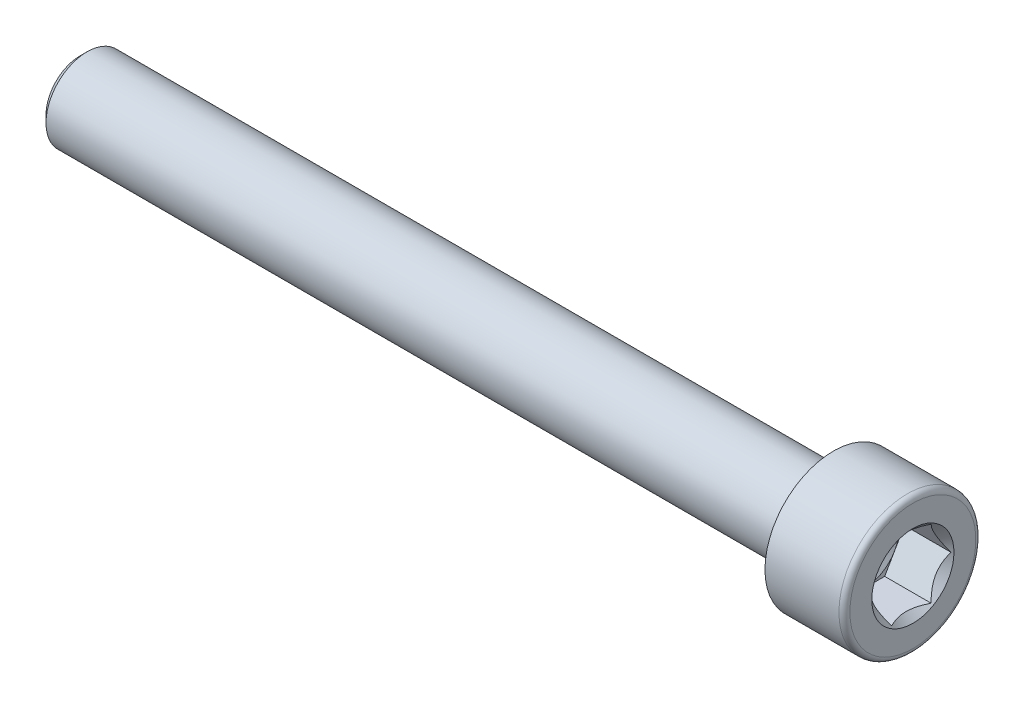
ISO-10303-21;
HEADER;
FILE_DESCRIPTION(('STEP AP214'),'2;1');
FILE_NAME('part.step','',(''),(''),'','','');
FILE_SCHEMA(('AUTOMOTIVE_DESIGN { 1 0 10303 214 1 1 1 1 }'));
ENDSEC;
DATA;
#1=APPLICATION_CONTEXT('core data for automotive mechanical design processes');
#2=APPLICATION_PROTOCOL_DEFINITION('international standard','automotive_design',2000,#1);
#3=PRODUCT_CONTEXT('',#1,'mechanical');
#4=PRODUCT('Part','Part','',(#3));
#5=PRODUCT_RELATED_PRODUCT_CATEGORY('part','',(#4));
#6=PRODUCT_DEFINITION_FORMATION('','',#4);
#7=PRODUCT_DEFINITION_CONTEXT('part definition',#1,'design');
#8=PRODUCT_DEFINITION('design','',#6,#7);
#9=PRODUCT_DEFINITION_SHAPE('','',#8);
#10=(LENGTH_UNIT() NAMED_UNIT(*) SI_UNIT(.MILLI.,.METRE.));
#11=(NAMED_UNIT(*) PLANE_ANGLE_UNIT() SI_UNIT($,.RADIAN.));
#12=(NAMED_UNIT(*) SI_UNIT($,.STERADIAN.) SOLID_ANGLE_UNIT());
#13=UNCERTAINTY_MEASURE_WITH_UNIT(LENGTH_MEASURE(1.E-05),#10,'distance_accuracy_value','');
#14=(GEOMETRIC_REPRESENTATION_CONTEXT(3) GLOBAL_UNCERTAINTY_ASSIGNED_CONTEXT((#13)) GLOBAL_UNIT_ASSIGNED_CONTEXT((#10,
#11,#12)) REPRESENTATION_CONTEXT('',''));
#15=CARTESIAN_POINT('',(0.,0.,0.));
#16=DIRECTION('',(0.,0.,1.));
#17=DIRECTION('',(1.,0.,0.));
#18=AXIS2_PLACEMENT_3D('',#15,#16,#17);
#19=CARTESIAN_POINT('',(-30.,0.,0.));
#20=DIRECTION('',(-1.,0.,0.));
#21=DIRECTION('',(0.,0.,1.));
#22=AXIS2_PLACEMENT_3D('',#19,#20,#21);
#23=CYLINDRICAL_SURFACE('',#22,3.);
#24=CARTESIAN_POINT('',(-54.5,0.,0.));
#25=DIRECTION('',(1.,0.,0.));
#26=DIRECTION('',(0.,0.,-1.));
#27=AXIS2_PLACEMENT_3D('',#24,#25,#26);
#28=CIRCLE('',#27,3.);
#29=CARTESIAN_POINT('',(-54.5,0.,-3.));
#30=VERTEX_POINT('',#29);
#31=EDGE_CURVE('E11',#30,#30,#28,.T.);
#32=ORIENTED_EDGE('',*,*,#31,.T.);
#33=EDGE_LOOP('',(#32));
#34=FACE_BOUND('',#33,.T.);
#35=CARTESIAN_POINT('',(0.,0.,0.));
#36=DIRECTION('',(-1.,0.,0.));
#37=DIRECTION('',(0.,0.,1.));
#38=AXIS2_PLACEMENT_3D('',#35,#36,#37);
#39=CIRCLE('',#38,3.);
#40=CARTESIAN_POINT('',(0.,0.,3.));
#41=VERTEX_POINT('',#40);
#42=EDGE_CURVE('E461',#41,#41,#39,.T.);
#43=ORIENTED_EDGE('',*,*,#42,.T.);
#44=EDGE_LOOP('',(#43));
#45=FACE_BOUND('',#44,.T.);
#46=ADVANCED_FACE('F348',(#34,#45),#23,.T.);
#47=CARTESIAN_POINT('',(-55.,0.,0.));
#48=DIRECTION('',(1.,0.,0.));
#49=DIRECTION('',(0.,0.,-1.));
#50=AXIS2_PLACEMENT_3D('',#47,#48,#49);
#51=PLANE('',#50);
#52=CARTESIAN_POINT('',(-55.,0.,0.));
#53=DIRECTION('',(1.,0.,0.));
#54=DIRECTION('',(0.,0.,-1.));
#55=AXIS2_PLACEMENT_3D('',#52,#53,#54);
#56=CIRCLE('',#55,2.5);
#57=CARTESIAN_POINT('',(-55.,0.,-2.5));
#58=VERTEX_POINT('',#57);
#59=EDGE_CURVE('E355',#58,#58,#56,.F.);
#60=ORIENTED_EDGE('',*,*,#59,.T.);
#61=EDGE_LOOP('',(#60));
#62=FACE_BOUND('',#61,.T.);
#63=ADVANCED_FACE('F535',(#62),#51,.F.);
#64=CARTESIAN_POINT('',(5.3,0.,0.));
#65=DIRECTION('',(1.,0.,0.));
#66=DIRECTION('',(0.,0.,-1.));
#67=AXIS2_PLACEMENT_3D('',#64,#65,#66);
#68=CONICAL_SURFACE('',#67,2.5,0.785398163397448);
#69=CARTESIAN_POINT('',(5.8,0.,0.));
#70=DIRECTION('',(-1.,0.,0.));
#71=DIRECTION('',(0.,0.,1.));
#72=AXIS2_PLACEMENT_3D('',#69,#70,#71);
#73=CIRCLE('',#72,3.);
#74=CARTESIAN_POINT('',(5.80000000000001,0.,3.));
#75=VERTEX_POINT('',#74);
#76=EDGE_CURVE('E484',#75,#75,#73,.T.);
#77=ORIENTED_EDGE('',*,*,#76,.F.);
#78=EDGE_LOOP('',(#77));
#79=FACE_BOUND('',#78,.T.);
#80=CARTESIAN_POINT('',(5.6868668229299,-2.50019999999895,1.44326020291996));
#81=CARTESIAN_POINT('',(5.63729205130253,-2.41426172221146,1.4928766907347));
#82=CARTESIAN_POINT('',(5.59062882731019,-2.32688643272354,1.54332283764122));
#83=CARTESIAN_POINT('',(5.50518948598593,-2.14871854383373,1.6461881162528));
#84=CARTESIAN_POINT('',(5.46646090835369,-2.05790899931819,1.69861703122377));
#85=CARTESIAN_POINT('',(5.40011804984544,-1.87479587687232,1.80433744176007));
#86=CARTESIAN_POINT('',(5.37233701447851,-1.78253893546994,1.85760201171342));
#87=CARTESIAN_POINT('',(5.32953452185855,-1.59599399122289,1.96530378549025));
#88=CARTESIAN_POINT('',(5.3144811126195,-1.50171168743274,2.01973769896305));
#89=CARTESIAN_POINT('',(5.30089906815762,-1.33922174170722,2.11355131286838));
#90=CARTESIAN_POINT('',(5.29888844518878,-1.27122403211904,2.15280980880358));
#91=CARTESIAN_POINT('',(5.30227546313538,-1.13533975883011,2.23126263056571));
#92=CARTESIAN_POINT('',(5.30767570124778,-1.0674532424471,2.27045692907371));
#93=CARTESIAN_POINT('',(5.32557713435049,-0.932321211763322,2.34847544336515));
#94=CARTESIAN_POINT('',(5.33808627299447,-0.865076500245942,2.38729919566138));
#95=CARTESIAN_POINT('',(5.36951884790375,-0.731749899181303,2.46427534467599));
#96=CARTESIAN_POINT('',(5.38844179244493,-0.66566792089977,2.50242779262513));
#97=CARTESIAN_POINT('',(5.44461870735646,-0.496403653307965,2.60015256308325));
#98=CARTESIAN_POINT('',(5.48610717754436,-0.39427087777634,2.65911894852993));
#99=CARTESIAN_POINT('',(5.55614539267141,-0.244093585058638,2.74582384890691));
#100=CARTESIAN_POINT('',(5.58075359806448,-0.194603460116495,2.7743969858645));
#101=CARTESIAN_POINT('',(5.63221323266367,-0.0965399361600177,2.83101398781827));
#102=CARTESIAN_POINT('',(5.65906328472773,-0.0479659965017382,2.85905816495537));
#103=CARTESIAN_POINT('',(5.6868668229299,0.000200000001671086,2.88686681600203));
#104=B_SPLINE_CURVE_WITH_KNOTS('',3,(#80,#81,#82,#83,#84,#85,#86,#87,#88,#89,#90,#91,#92,#93,
#94,#95,#96,#97,#98,#99,#100,#101,#102,#103),.UNSPECIFIED.,.F.,.F.,(4,2,2,2,2,2,2,2,2,2,2,4),
(0.,0.333012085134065,0.667964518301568,0.997597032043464,1.32639954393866,1.56169424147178,
1.79707142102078,2.03271213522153,2.26833478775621,2.64260240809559,2.82922877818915,
3.01574133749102),.UNSPECIFIED.);
#105=CARTESIAN_POINT('',(5.68675134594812,-2.49999999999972,1.44337567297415));
#106=VERTEX_POINT('',#105);
#107=CARTESIAN_POINT('',(5.68675134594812,6.66133814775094E-13,2.88675134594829));
#108=VERTEX_POINT('',#107);
#109=EDGE_CURVE('E489',#106,#108,#104,.T.);
#110=ORIENTED_EDGE('',*,*,#109,.T.);
#111=CARTESIAN_POINT('',(5.6868668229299,-0.00019999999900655,2.8868668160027));
#112=CARTESIAN_POINT('',(5.63729205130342,0.0857382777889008,2.83725032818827));
#113=CARTESIAN_POINT('',(5.59062882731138,0.173113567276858,2.78680418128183));
#114=CARTESIAN_POINT('',(5.50518948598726,0.351281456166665,2.68393890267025));
#115=CARTESIAN_POINT('',(5.46646090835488,0.442091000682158,2.63150998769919));
#116=CARTESIAN_POINT('',(5.40011804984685,0.625204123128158,2.52578957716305));
#117=CARTESIAN_POINT('',(5.37233701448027,0.71746106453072,2.47252500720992));
#118=CARTESIAN_POINT('',(5.32953452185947,0.904006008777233,2.36482323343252));
#119=CARTESIAN_POINT('',(5.31448111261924,0.998288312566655,2.31038931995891));
#120=CARTESIAN_POINT('',(5.30089906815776,1.16077825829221,2.21657570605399));
#121=CARTESIAN_POINT('',(5.29888844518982,1.2287759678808,2.17731721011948));
#122=CARTESIAN_POINT('',(5.30227546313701,1.36466024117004,2.0988643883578));
#123=CARTESIAN_POINT('',(5.3076757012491,1.43254675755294,2.05967008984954));
#124=CARTESIAN_POINT('',(5.32557713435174,1.56767878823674,1.98165157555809));
#125=CARTESIAN_POINT('',(5.33808627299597,1.63492349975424,1.9428278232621));
#126=CARTESIAN_POINT('',(5.36951884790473,1.76825010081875,1.86585167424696));
#127=CARTESIAN_POINT('',(5.38844179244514,1.83433207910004,1.82769922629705));
#128=CARTESIAN_POINT('',(5.44461870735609,2.00359634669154,1.72997445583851));
#129=CARTESIAN_POINT('',(5.48610717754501,2.10572912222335,1.67100807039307));
#130=CARTESIAN_POINT('',(5.55614539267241,2.25590641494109,1.58430317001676));
#131=CARTESIAN_POINT('',(5.58075359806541,2.30539653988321,1.55573003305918));
#132=CARTESIAN_POINT('',(5.63221323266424,2.40346006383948,1.49911303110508));
#133=CARTESIAN_POINT('',(5.65906328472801,2.45203400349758,1.47106885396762));
#134=CARTESIAN_POINT('',(5.6868668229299,2.50020000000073,1.4432602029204));
#135=B_SPLINE_CURVE_WITH_KNOTS('',3,(#111,#112,#113,#114,#115,#116,#117,#118,#119,#120,#121,
#122,#123,#124,#125,#126,#127,#128,#129,#130,#131,#132,#133,#134),.UNSPECIFIED.,.F.,.F.,(4,2,2,
2,2,2,2,2,2,2,2,4),(0.,0.333012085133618,0.667964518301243,0.997597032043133,1.32639954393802,
1.56169424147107,1.79707142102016,2.032712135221,2.26833478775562,2.64260240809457,
2.829228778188,3.01574133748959),.UNSPECIFIED.);
#136=CARTESIAN_POINT('',(5.68675134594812,2.50000000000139,1.44337567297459));
#137=VERTEX_POINT('',#136);
#138=EDGE_CURVE('E370',#108,#137,#135,.T.);
#139=ORIENTED_EDGE('',*,*,#138,.T.);
#140=CARTESIAN_POINT('',(6.74994835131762,2.50000000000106,-3.05811902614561));
#141=CARTESIAN_POINT('',(6.69289416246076,2.50000000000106,-2.98440983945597));
#142=CARTESIAN_POINT('',(6.63633840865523,2.50000000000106,-2.91030875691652));
#143=CARTESIAN_POINT('',(6.52445299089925,2.50000000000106,-2.76116077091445));
#144=CARTESIAN_POINT('',(6.46912361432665,2.50000000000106,-2.68611365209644));
#145=CARTESIAN_POINT('',(6.35952665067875,2.50000000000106,-2.53436379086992));
#146=CARTESIAN_POINT('',(6.30527051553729,2.50000000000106,-2.45765275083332));
#147=CARTESIAN_POINT('',(6.19860260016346,2.50000000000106,-2.30296317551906));
#148=CARTESIAN_POINT('',(6.14619069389,2.50000000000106,-2.22498472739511));
#149=CARTESIAN_POINT('',(6.04026321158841,2.50000000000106,-2.06236769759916));
#150=CARTESIAN_POINT('',(5.98690162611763,2.50000000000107,-1.97762830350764));
#151=CARTESIAN_POINT('',(5.88344307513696,2.50000000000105,-1.80618229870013));
#152=CARTESIAN_POINT('',(5.83334568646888,2.50000000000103,-1.719475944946));
#153=CARTESIAN_POINT('',(5.73745253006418,2.50000000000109,-1.54402392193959));
#154=CARTESIAN_POINT('',(5.6916447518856,2.50000000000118,-1.45528486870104));
#155=CARTESIAN_POINT('',(5.60536574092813,2.50000000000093,-1.27526975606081));
#156=CARTESIAN_POINT('',(5.56489195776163,2.50000000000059,-1.18399493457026));
#157=CARTESIAN_POINT('',(5.49462825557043,2.50000000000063,-1.00836471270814));
#158=CARTESIAN_POINT('',(5.46416406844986,2.50000000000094,-0.924281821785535));
#159=CARTESIAN_POINT('',(5.40996243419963,2.50000000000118,-0.753934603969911));
#160=CARTESIAN_POINT('',(5.38622540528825,2.50000000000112,-0.667670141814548));
#161=CARTESIAN_POINT('',(5.34717521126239,2.50000000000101,-0.495001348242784));
#162=CARTESIAN_POINT('',(5.33170602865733,2.50000000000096,-0.408632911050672));
#163=CARTESIAN_POINT('',(5.30952108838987,2.50000000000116,-0.234772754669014));
#164=CARTESIAN_POINT('',(5.30280339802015,2.5000000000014,-0.147281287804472));
#165=CARTESIAN_POINT('',(5.2987182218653,2.50000000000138,0.0238518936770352));
#166=CARTESIAN_POINT('',(5.3009308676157,2.50000000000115,0.107483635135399));
#167=CARTESIAN_POINT('',(5.31360968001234,2.50000000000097,0.274114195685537));
#168=CARTESIAN_POINT('',(5.32407657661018,2.50000000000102,0.357112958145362));
#169=CARTESIAN_POINT('',(5.35284213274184,2.5000000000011,0.523288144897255));
#170=CARTESIAN_POINT('',(5.37128080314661,2.50000000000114,0.606439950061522));
#171=CARTESIAN_POINT('',(5.41495620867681,2.50000000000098,0.770896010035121));
#172=CARTESIAN_POINT('',(5.44019262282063,2.50000000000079,0.852200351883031));
#173=CARTESIAN_POINT('',(5.52700067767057,2.50000000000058,1.10064624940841));
#174=CARTESIAN_POINT('',(5.59813375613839,2.50000000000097,1.26445670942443));
#175=CARTESIAN_POINT('',(5.71682012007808,2.50000000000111,1.504212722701));
#176=CARTESIAN_POINT('',(5.75847161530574,2.50000000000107,1.58328419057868));
#177=CARTESIAN_POINT('',(5.84501240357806,2.50000000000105,1.7396392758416));
#178=CARTESIAN_POINT('',(5.88990113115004,2.50000000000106,1.81692320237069));
#179=CARTESIAN_POINT('',(5.97999121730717,2.50000000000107,1.9661389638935));
#180=CARTESIAN_POINT('',(6.02506807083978,2.50000000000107,2.03814682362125));
#181=CARTESIAN_POINT('',(6.11714731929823,2.50000000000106,2.180926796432));
#182=CARTESIAN_POINT('',(6.16414985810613,2.50000000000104,2.25169881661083));
#183=CARTESIAN_POINT('',(6.25935501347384,2.50000000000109,2.39159945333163));
#184=CARTESIAN_POINT('',(6.30754501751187,2.50000000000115,2.46073668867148));
#185=CARTESIAN_POINT('',(6.40522114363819,2.50000000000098,2.59806183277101));
#186=CARTESIAN_POINT('',(6.45470690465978,2.50000000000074,2.66624999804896));
#187=CARTESIAN_POINT('',(6.50472334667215,2.50000000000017,2.73404006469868));
#188=B_SPLINE_CURVE_WITH_KNOTS('',3,(#140,#141,#142,#143,#144,#145,#146,#147,#148,#149,#150,
#151,#152,#153,#154,#155,#156,#157,#158,#159,#160,#161,#162,#163,#164,#165,#166,#167,#168,#169,
#170,#171,#172,#173,#174,#175,#176,#177,#178,#179,#180,#181,#182,#183,#184,#185,#186,#187),
.UNSPECIFIED.,.F.,.F.,(4,2,2,2,2,2,2,2,2,2,2,2,2,2,2,2,2,2,2,2,2,2,2,4),(0.,0.279636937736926,
0.55933872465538,0.841193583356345,1.1230291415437,1.42339426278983,1.72372036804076,
2.02317874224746,2.32249341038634,2.59055815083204,2.85863955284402,3.12146553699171,
3.3842334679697,3.63479445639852,3.88537760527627,4.14055298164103,4.39571631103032,
4.92983151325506,5.19792074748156,5.46596326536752,5.7207918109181,5.97563943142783,
6.22844778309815,6.48118642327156),.UNSPECIFIED.);
#189=CARTESIAN_POINT('',(5.68675134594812,2.50000000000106,-1.44337567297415));
#190=VERTEX_POINT('',#189);
#191=EDGE_CURVE('E526',#137,#190,#188,.F.);
#192=ORIENTED_EDGE('',*,*,#191,.T.);
#193=CARTESIAN_POINT('',(5.68686682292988,2.50020000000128,-1.44326020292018));
#194=CARTESIAN_POINT('',(5.63729205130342,2.41426172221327,-1.49287669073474));
#195=CARTESIAN_POINT('',(5.59062882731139,2.32688643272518,-1.54332283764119));
#196=CARTESIAN_POINT('',(5.50518948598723,2.14871854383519,-1.64618811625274));
#197=CARTESIAN_POINT('',(5.4664609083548,2.05790899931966,-1.69861703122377));
#198=CARTESIAN_POINT('',(5.40011804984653,1.87479587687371,-1.80433744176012));
#199=CARTESIAN_POINT('',(5.37233701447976,1.78253893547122,-1.85760201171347));
#200=CARTESIAN_POINT('',(5.32953452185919,1.5959939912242,-1.9653037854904));
#201=CARTESIAN_POINT('',(5.31448111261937,1.50171168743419,-2.01973769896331));
#202=CARTESIAN_POINT('',(5.30089906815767,1.33922174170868,-2.11355131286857));
#203=CARTESIAN_POINT('',(5.29888844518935,1.27122403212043,-2.15280980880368));
#204=CARTESIAN_POINT('',(5.30227546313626,1.13533975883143,-2.23126263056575));
#205=CARTESIAN_POINT('',(5.30767570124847,1.06745324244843,-2.2704569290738));
#206=CARTESIAN_POINT('',(5.32557713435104,0.932321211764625,-2.34847544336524));
#207=CARTESIAN_POINT('',(5.33808627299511,0.865076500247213,-2.38729919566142));
#208=CARTESIAN_POINT('',(5.36951884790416,0.731749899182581,-2.46427534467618));
#209=CARTESIAN_POINT('',(5.38844179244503,0.665667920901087,-2.50242779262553));
#210=CARTESIAN_POINT('',(5.44461870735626,0.496403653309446,-2.60015256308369));
#211=CARTESIAN_POINT('',(5.48610717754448,0.394270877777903,-2.65911894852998));
#212=CARTESIAN_POINT('',(5.5561453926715,0.244093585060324,-2.74582384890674));
#213=CARTESIAN_POINT('',(5.58075359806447,0.194603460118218,-2.77439698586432));
#214=CARTESIAN_POINT('',(5.63221323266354,0.0965399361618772,-2.83101398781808));
#215=CARTESIAN_POINT('',(5.65906328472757,0.0479659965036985,-2.85905816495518));
#216=CARTESIAN_POINT('',(5.68686682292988,-0.000199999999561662,-2.88686681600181));
#217=B_SPLINE_CURVE_WITH_KNOTS('',3,(#193,#194,#195,#196,#197,#198,#199,#200,#201,#202,#203,
#204,#205,#206,#207,#208,#209,#210,#211,#212,#213,#214,#215,#216),.UNSPECIFIED.,.F.,.F.,(4,2,2,
2,2,2,2,2,2,2,2,4),(0.,0.333012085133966,0.667964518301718,0.997597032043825,1.32639954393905,
1.56169424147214,1.79707142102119,2.03271213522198,2.26833478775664,2.64260240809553,
2.82922877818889,3.0157413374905),.UNSPECIFIED.);
#218=CARTESIAN_POINT('',(5.68675134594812,7.7715611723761E-13,-2.88675134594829));
#219=VERTEX_POINT('',#218);
#220=EDGE_CURVE('E609',#190,#219,#217,.T.);
#221=ORIENTED_EDGE('',*,*,#220,.T.);
#222=CARTESIAN_POINT('',(5.68686682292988,0.000200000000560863,-2.88686681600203));
#223=CARTESIAN_POINT('',(5.63729205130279,-0.085738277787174,-2.83725032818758));
#224=CARTESIAN_POINT('',(5.59062882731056,-0.173113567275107,-2.78680418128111));
#225=CARTESIAN_POINT('',(5.50518948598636,-0.351281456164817,-2.68393890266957));
#226=CARTESIAN_POINT('',(5.46646090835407,-0.442091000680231,-2.63150998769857));
#227=CARTESIAN_POINT('',(5.40011804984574,-0.625204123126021,-2.52578957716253));
#228=CARTESIAN_POINT('',(5.37233701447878,-0.717461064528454,-2.47252500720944));
#229=CARTESIAN_POINT('',(5.3295345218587,-0.904006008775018,-2.3648232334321));
#230=CARTESIAN_POINT('',(5.31448111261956,-0.998288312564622,-2.31038931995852));
#231=CARTESIAN_POINT('',(5.30089906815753,-1.16077825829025,-2.2165757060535));
#232=CARTESIAN_POINT('',(5.29888844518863,-1.22877596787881,-2.1773172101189));
#233=CARTESIAN_POINT('',(5.30227546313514,-1.36466024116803,-2.0988643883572));
#234=CARTESIAN_POINT('',(5.30767570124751,-1.43254675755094,-2.059670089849));
#235=CARTESIAN_POINT('',(5.32557713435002,-1.56767878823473,-1.98165157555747));
#236=CARTESIAN_POINT('',(5.33808627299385,-1.63492349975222,-1.94282782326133));
#237=CARTESIAN_POINT('',(5.36951884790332,-1.76825010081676,-1.86585167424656));
#238=CARTESIAN_POINT('',(5.38844179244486,-1.83433207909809,-1.82769922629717));
#239=CARTESIAN_POINT('',(5.44461870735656,-2.00359634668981,-1.72997445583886));
#240=CARTESIAN_POINT('',(5.48610717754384,-2.10572912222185,-1.67100807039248));
#241=CARTESIAN_POINT('',(5.55614539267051,-2.25590641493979,-1.58430317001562));
#242=CARTESIAN_POINT('',(5.58075359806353,-2.30539653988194,-1.555730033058));
#243=CARTESIAN_POINT('',(5.63221323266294,-2.4034600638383,-1.49911303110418));
#244=CARTESIAN_POINT('',(5.65906328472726,-2.45203400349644,-1.47106885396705));
#245=CARTESIAN_POINT('',(5.6868668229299,-2.50019999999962,-1.4432602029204));
#246=B_SPLINE_CURVE_WITH_KNOTS('',3,(#222,#223,#224,#225,#226,#227,#228,#229,#230,#231,#232,
#233,#234,#235,#236,#237,#238,#239,#240,#241,#242,#243,#244,#245),.UNSPECIFIED.,.F.,.F.,(4,2,2,
2,2,2,2,2,2,2,2,4),(0.,0.333012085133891,0.667964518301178,0.99759703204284,1.32639954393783,
1.56169424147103,1.79707142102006,2.03271213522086,2.26833478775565,2.64260240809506,
2.82922877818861,3.01574133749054),.UNSPECIFIED.);
#247=CARTESIAN_POINT('',(5.68675134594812,-2.4999999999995,-1.44337567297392));
#248=VERTEX_POINT('',#247);
#249=EDGE_CURVE('E610',#219,#248,#246,.T.);
#250=ORIENTED_EDGE('',*,*,#249,.T.);
#251=CARTESIAN_POINT('',(6.74994835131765,-2.49999999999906,-3.05811902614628));
#252=CARTESIAN_POINT('',(6.69289416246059,-2.49999999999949,-2.9844098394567));
#253=CARTESIAN_POINT('',(6.63633840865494,-2.49999999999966,-2.91030875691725));
#254=CARTESIAN_POINT('',(6.52445299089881,-2.49999999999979,-2.76116077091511));
#255=CARTESIAN_POINT('',(6.46912361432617,-2.49999999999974,-2.68611365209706));
#256=CARTESIAN_POINT('',(6.35952665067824,-2.49999999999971,-2.53436379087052));
#257=CARTESIAN_POINT('',(6.30527051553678,-2.49999999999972,-2.45765275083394));
#258=CARTESIAN_POINT('',(6.19860260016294,-2.49999999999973,-2.30296317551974));
#259=CARTESIAN_POINT('',(6.14619069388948,-2.49999999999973,-2.22498472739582));
#260=CARTESIAN_POINT('',(6.04026321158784,-2.49999999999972,-2.06236769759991));
#261=CARTESIAN_POINT('',(5.98690162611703,-2.49999999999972,-1.9776283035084));
#262=CARTESIAN_POINT('',(5.88344307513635,-2.49999999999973,-1.8061822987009));
#263=CARTESIAN_POINT('',(5.8333456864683,-2.49999999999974,-1.71947594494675));
#264=CARTESIAN_POINT('',(5.73745253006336,-2.49999999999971,-1.54402392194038));
#265=CARTESIAN_POINT('',(5.6916447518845,-2.49999999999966,-1.45528486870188));
#266=CARTESIAN_POINT('',(5.60536574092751,-2.49999999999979,-1.27526975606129));
#267=CARTESIAN_POINT('',(5.56489195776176,-2.49999999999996,-1.18399493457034));
#268=CARTESIAN_POINT('',(5.49462825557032,-2.49999999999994,-1.00836471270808));
#269=CARTESIAN_POINT('',(5.46416406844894,-2.49999999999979,-0.924281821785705));
#270=CARTESIAN_POINT('',(5.40996243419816,-2.49999999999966,-0.753934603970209));
#271=CARTESIAN_POINT('',(5.38622540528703,-2.49999999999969,-0.667670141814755));
#272=CARTESIAN_POINT('',(5.34717521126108,-2.49999999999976,-0.495001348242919));
#273=CARTESIAN_POINT('',(5.33170602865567,-2.49999999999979,-0.408632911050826));
#274=CARTESIAN_POINT('',(5.30952108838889,-2.49999999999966,-0.234772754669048));
#275=CARTESIAN_POINT('',(5.30280339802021,-2.49999999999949,-0.147281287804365));
#276=CARTESIAN_POINT('',(5.29871822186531,-2.49999999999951,0.0238518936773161));
#277=CARTESIAN_POINT('',(5.30093086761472,-2.49999999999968,0.107483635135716));
#278=CARTESIAN_POINT('',(5.3136096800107,-2.49999999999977,0.274114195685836));
#279=CARTESIAN_POINT('',(5.32407657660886,-2.4999999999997,0.357112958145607));
#280=CARTESIAN_POINT('',(5.3528421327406,-2.49999999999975,0.523288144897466));
#281=CARTESIAN_POINT('',(5.37128080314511,-2.49999999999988,0.606439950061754));
#282=CARTESIAN_POINT('',(5.41495620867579,-2.49999999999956,0.770896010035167));
#283=CARTESIAN_POINT('',(5.44019262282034,-2.49999999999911,0.852200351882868));
#284=CARTESIAN_POINT('',(5.5270006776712,-2.4999999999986,1.10064624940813));
#285=CARTESIAN_POINT('',(5.59813375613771,-2.49999999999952,1.26445670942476));
#286=CARTESIAN_POINT('',(5.71682012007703,-2.49999999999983,1.50421272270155));
#287=CARTESIAN_POINT('',(5.75847161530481,-2.49999999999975,1.58328419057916));
#288=CARTESIAN_POINT('',(5.84501240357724,-2.49999999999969,1.73963927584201));
#289=CARTESIAN_POINT('',(5.88990113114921,-2.49999999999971,1.81692320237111));
#290=CARTESIAN_POINT('',(5.97999121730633,-2.49999999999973,1.96613896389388));
#291=CARTESIAN_POINT('',(6.02506807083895,-2.49999999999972,2.0381468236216));
#292=CARTESIAN_POINT('',(6.1171473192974,-2.49999999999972,2.18092679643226));
#293=CARTESIAN_POINT('',(6.1641498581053,-2.49999999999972,2.25169881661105));
#294=CARTESIAN_POINT('',(6.259355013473,-2.49999999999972,2.39159945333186));
#295=CARTESIAN_POINT('',(6.30754501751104,-2.49999999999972,2.46073668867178));
#296=CARTESIAN_POINT('',(6.40522114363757,-2.49999999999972,2.59806183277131));
#297=CARTESIAN_POINT('',(6.45470690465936,-2.49999999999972,2.6662499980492));
#298=CARTESIAN_POINT('',(6.50472334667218,-2.49999999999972,2.73404006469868));
#299=B_SPLINE_CURVE_WITH_KNOTS('',3,(#251,#252,#253,#254,#255,#256,#257,#258,#259,#260,#261,
#262,#263,#264,#265,#266,#267,#268,#269,#270,#271,#272,#273,#274,#275,#276,#277,#278,#279,#280,
#281,#282,#283,#284,#285,#286,#287,#288,#289,#290,#291,#292,#293,#294,#295,#296,#297,#298),
.UNSPECIFIED.,.F.,.F.,(4,2,2,2,2,2,2,2,2,2,2,2,2,2,2,2,2,2,2,2,2,2,2,4),(0.,0.279636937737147,
0.559338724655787,0.841193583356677,1.12302914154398,1.42339426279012,1.72372036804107,
2.02317874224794,2.3224934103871,2.59055815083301,2.85863955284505,3.12146553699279,
3.38423346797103,3.63479445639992,3.88537760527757,4.14055298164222,4.39571631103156,
4.92983151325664,5.19792074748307,5.46596326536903,5.72079181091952,5.97563943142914,
6.22844778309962,6.48118642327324),.UNSPECIFIED.);
#300=EDGE_CURVE('E497',#248,#106,#299,.T.);
#301=ORIENTED_EDGE('',*,*,#300,.T.);
#302=EDGE_LOOP('',(#110,#139,#192,#221,#250,#301));
#303=FACE_BOUND('',#302,.T.);
#304=ADVANCED_FACE('F503',(#79,#303),#68,.F.);
#305=CARTESIAN_POINT('',(5.8,4.60000000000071,2.22044604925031E-13));
#306=DIRECTION('',(-1.,0.,0.));
#307=DIRECTION('',(0.,0.,1.));
#308=AXIS2_PLACEMENT_3D('',#305,#306,#307);
#309=PLANE('',#308);
#310=CARTESIAN_POINT('',(5.8,0.,0.));
#311=DIRECTION('',(-1.,0.,0.));
#312=DIRECTION('',(0.,0.,1.));
#313=AXIS2_PLACEMENT_3D('',#310,#311,#312);
#314=CIRCLE('',#313,4.6);
#315=CARTESIAN_POINT('',(5.80000000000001,0.,4.6));
#316=VERTEX_POINT('',#315);
#317=EDGE_CURVE('E481',#316,#316,#314,.T.);
#318=ORIENTED_EDGE('',*,*,#317,.F.);
#319=EDGE_LOOP('',(#318));
#320=FACE_BOUND('',#319,.T.);
#321=ORIENTED_EDGE('',*,*,#76,.T.);
#322=EDGE_LOOP('',(#321));
#323=FACE_BOUND('',#322,.T.);
#324=ADVANCED_FACE('F568',(#320,#323),#309,.F.);
#325=CARTESIAN_POINT('',(5.39999999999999,0.,0.));
#326=DIRECTION('',(-1.,0.,0.));
#327=DIRECTION('',(0.,0.,1.));
#328=AXIS2_PLACEMENT_3D('',#325,#326,#327);
#329=TOROIDAL_SURFACE('',#328,4.6,0.4);
#330=CARTESIAN_POINT('',(5.39999999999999,0.,0.));
#331=DIRECTION('',(-1.,0.,0.));
#332=DIRECTION('',(0.,0.,1.));
#333=AXIS2_PLACEMENT_3D('',#330,#331,#332);
#334=CIRCLE('',#333,5.);
#335=CARTESIAN_POINT('',(5.4,0.,5.00000000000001));
#336=VERTEX_POINT('',#335);
#337=EDGE_CURVE('E478',#336,#336,#334,.T.);
#338=ORIENTED_EDGE('',*,*,#337,.F.);
#339=EDGE_LOOP('',(#338));
#340=FACE_BOUND('',#339,.T.);
#341=ORIENTED_EDGE('',*,*,#317,.T.);
#342=EDGE_LOOP('',(#341));
#343=FACE_BOUND('',#342,.T.);
#344=ADVANCED_FACE('F563',(#340,#343),#329,.T.);
#345=CARTESIAN_POINT('',(-30.,0.,0.));
#346=DIRECTION('',(-1.,0.,0.));
#347=DIRECTION('',(0.,0.,1.));
#348=AXIS2_PLACEMENT_3D('',#345,#346,#347);
#349=CYLINDRICAL_SURFACE('',#348,5.);
#350=CARTESIAN_POINT('',(0.,0.,0.));
#351=DIRECTION('',(-1.,0.,0.));
#352=DIRECTION('',(0.,0.,1.));
#353=AXIS2_PLACEMENT_3D('',#350,#351,#352);
#354=CIRCLE('',#353,5.);
#355=CARTESIAN_POINT('',(0.,0.,5.));
#356=VERTEX_POINT('',#355);
#357=EDGE_CURVE('E475',#356,#356,#354,.T.);
#358=ORIENTED_EDGE('',*,*,#357,.F.);
#359=EDGE_LOOP('',(#358));
#360=FACE_BOUND('',#359,.T.);
#361=ORIENTED_EDGE('',*,*,#337,.T.);
#362=EDGE_LOOP('',(#361));
#363=FACE_BOUND('',#362,.T.);
#364=ADVANCED_FACE('F558',(#360,#363),#349,.T.);
#365=CARTESIAN_POINT('',(0.,3.00000000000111,2.22044604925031E-13));
#366=DIRECTION('',(1.,0.,0.));
#367=DIRECTION('',(0.,0.,-1.));
#368=AXIS2_PLACEMENT_3D('',#365,#366,#367);
#369=PLANE('',#368);
#370=ORIENTED_EDGE('',*,*,#42,.F.);
#371=EDGE_LOOP('',(#370));
#372=FACE_BOUND('',#371,.T.);
#373=ORIENTED_EDGE('',*,*,#357,.T.);
#374=EDGE_LOOP('',(#373));
#375=FACE_BOUND('',#374,.T.);
#376=ADVANCED_FACE('F519',(#372,#375),#369,.F.);
#377=CARTESIAN_POINT('',(2.3,6.66133814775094E-13,2.88675134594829));
#378=DIRECTION('',(1.,0.,0.));
#379=DIRECTION('',(0.,0.,-1.));
#380=AXIS2_PLACEMENT_3D('',#377,#378,#379);
#381=PLANE('',#380);
#382=CARTESIAN_POINT('',(2.3,0.,0.));
#383=DIRECTION('',(-1.,0.,0.));
#384=DIRECTION('',(0.,0.,1.));
#385=AXIS2_PLACEMENT_3D('',#382,#383,#384);
#386=CIRCLE('',#385,2.5);
#387=CARTESIAN_POINT('',(2.3,-1.24999999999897,-2.165063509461));
#388=VERTEX_POINT('',#387);
#389=CARTESIAN_POINT('',(2.3,-2.49999999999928,-2.22044604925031E-13));
#390=VERTEX_POINT('',#389);
#391=EDGE_CURVE('E593',#388,#390,#386,.T.);
#392=ORIENTED_EDGE('',*,*,#391,.T.);
#393=DIRECTION('',(0.,0.,-1.));
#394=VECTOR('',#393,1.);
#395=CARTESIAN_POINT('',(2.3,-2.49999999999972,1.44337567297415));
#396=LINE('',#395,#394);
#397=CARTESIAN_POINT('',(2.3,-2.4999999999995,-1.44337567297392));
#398=VERTEX_POINT('',#397);
#399=EDGE_CURVE('E444',#390,#398,#396,.T.);
#400=ORIENTED_EDGE('',*,*,#399,.T.);
#401=DIRECTION('',(0.,0.866025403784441,-0.500000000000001));
#402=VECTOR('',#401,1.);
#403=CARTESIAN_POINT('',(2.3,-2.4999999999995,-1.44337567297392));
#404=LINE('',#403,#402);
#405=EDGE_CURVE('E451',#398,#388,#404,.T.);
#406=ORIENTED_EDGE('',*,*,#405,.T.);
#407=EDGE_LOOP('',(#392,#400,#406));
#408=FACE_BOUND('',#407,.T.);
#409=ADVANCED_FACE('F557',(#408),#381,.T.);
#410=CARTESIAN_POINT('',(2.3,-1.24999999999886,2.165063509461));
#411=VERTEX_POINT('',#410);
#412=EDGE_CURVE('E588',#390,#411,#386,.T.);
#413=ORIENTED_EDGE('',*,*,#412,.T.);
#414=DIRECTION('',(0.,-0.866025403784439,-0.5));
#415=VECTOR('',#414,1.);
#416=CARTESIAN_POINT('',(2.3,6.66133814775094E-13,2.88675134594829));
#417=LINE('',#416,#415);
#418=CARTESIAN_POINT('',(2.3,-2.49999999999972,1.44337567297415));
#419=VERTEX_POINT('',#418);
#420=EDGE_CURVE('E443',#411,#419,#417,.T.);
#421=ORIENTED_EDGE('',*,*,#420,.T.);
#422=EDGE_CURVE('E446',#419,#390,#396,.T.);
#423=ORIENTED_EDGE('',*,*,#422,.T.);
#424=EDGE_LOOP('',(#413,#421,#423));
#425=FACE_BOUND('',#424,.T.);
#426=ADVANCED_FACE('F587',(#425),#381,.T.);
#427=CARTESIAN_POINT('',(2.3,1.25000000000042,2.16506350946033));
#428=VERTEX_POINT('',#427);
#429=EDGE_CURVE('E428',#411,#428,#386,.T.);
#430=ORIENTED_EDGE('',*,*,#429,.T.);
#431=DIRECTION('',(0.,-0.866025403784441,0.500000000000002));
#432=VECTOR('',#431,1.);
#433=CARTESIAN_POINT('',(2.3,2.50000000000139,1.44337567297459));
#434=LINE('',#433,#432);
#435=CARTESIAN_POINT('',(2.3,6.66133814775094E-13,2.88675134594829));
#436=VERTEX_POINT('',#435);
#437=EDGE_CURVE('E423',#428,#436,#434,.T.);
#438=ORIENTED_EDGE('',*,*,#437,.T.);
#439=EDGE_CURVE('E426',#436,#411,#417,.T.);
#440=ORIENTED_EDGE('',*,*,#439,.T.);
#441=EDGE_LOOP('',(#430,#438,#440));
#442=FACE_BOUND('',#441,.T.);
#443=ADVANCED_FACE('F424',(#442),#381,.T.);
#444=CARTESIAN_POINT('',(2.3,2.50000000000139,2.22044604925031E-13));
#445=VERTEX_POINT('',#444);
#446=EDGE_CURVE('E487',#428,#445,#386,.T.);
#447=ORIENTED_EDGE('',*,*,#446,.T.);
#448=DIRECTION('',(0.,0.,1.));
#449=VECTOR('',#448,1.);
#450=CARTESIAN_POINT('',(2.3,2.50000000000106,-1.44337567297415));
#451=LINE('',#450,#449);
#452=CARTESIAN_POINT('',(2.3,2.50000000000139,1.44337567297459));
#453=VERTEX_POINT('',#452);
#454=EDGE_CURVE('E456',#445,#453,#451,.T.);
#455=ORIENTED_EDGE('',*,*,#454,.T.);
#456=EDGE_CURVE('E431',#453,#428,#434,.T.);
#457=ORIENTED_EDGE('',*,*,#456,.T.);
#458=EDGE_LOOP('',(#447,#455,#457));
#459=FACE_BOUND('',#458,.T.);
#460=ADVANCED_FACE('F605',(#459),#381,.T.);
#461=CARTESIAN_POINT('',(2.3,1.25000000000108,-2.16506350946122));
#462=VERTEX_POINT('',#461);
#463=EDGE_CURVE('E490',#445,#462,#386,.T.);
#464=ORIENTED_EDGE('',*,*,#463,.T.);
#465=DIRECTION('',(0.,0.866025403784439,0.5));
#466=VECTOR('',#465,1.);
#467=CARTESIAN_POINT('',(2.3,7.7715611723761E-13,-2.88675134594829));
#468=LINE('',#467,#466);
#469=CARTESIAN_POINT('',(2.3,2.50000000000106,-1.44337567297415));
#470=VERTEX_POINT('',#469);
#471=EDGE_CURVE('E454',#462,#470,#468,.T.);
#472=ORIENTED_EDGE('',*,*,#471,.T.);
#473=EDGE_CURVE('E438',#470,#445,#451,.T.);
#474=ORIENTED_EDGE('',*,*,#473,.T.);
#475=EDGE_LOOP('',(#464,#472,#474));
#476=FACE_BOUND('',#475,.T.);
#477=ADVANCED_FACE('F600',(#476),#381,.T.);
#478=EDGE_CURVE('E594',#462,#388,#386,.T.);
#479=ORIENTED_EDGE('',*,*,#478,.T.);
#480=CARTESIAN_POINT('',(2.3,7.7715611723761E-13,-2.88675134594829));
#481=VERTEX_POINT('',#480);
#482=EDGE_CURVE('E450',#388,#481,#404,.T.);
#483=ORIENTED_EDGE('',*,*,#482,.T.);
#484=EDGE_CURVE('E362',#481,#462,#468,.T.);
#485=ORIENTED_EDGE('',*,*,#484,.T.);
#486=EDGE_LOOP('',(#479,#483,#485));
#487=FACE_BOUND('',#486,.T.);
#488=ADVANCED_FACE('F518',(#487),#381,.T.);
#489=CARTESIAN_POINT('',(2.3,2.50000000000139,1.44337567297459));
#490=DIRECTION('',(0.,0.500000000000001,0.866025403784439));
#491=DIRECTION('',(0.,-0.866025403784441,0.500000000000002));
#492=AXIS2_PLACEMENT_3D('',#489,#490,#491);
#493=PLANE('',#492);
#494=ORIENTED_EDGE('',*,*,#456,.F.);
#495=DIRECTION('',(1.,0.,0.));
#496=VECTOR('',#495,1.);
#497=CARTESIAN_POINT('',(2.3,2.50000000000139,1.44337567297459));
#498=LINE('',#497,#496);
#499=EDGE_CURVE('E459',#453,#137,#498,.T.);
#500=ORIENTED_EDGE('',*,*,#499,.T.);
#501=ORIENTED_EDGE('',*,*,#138,.F.);
#502=DIRECTION('',(1.,0.,0.));
#503=VECTOR('',#502,1.);
#504=CARTESIAN_POINT('',(2.3,6.66133814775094E-13,2.88675134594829));
#505=LINE('',#504,#503);
#506=EDGE_CURVE('E433',#436,#108,#505,.T.);
#507=ORIENTED_EDGE('',*,*,#506,.F.);
#508=ORIENTED_EDGE('',*,*,#437,.F.);
#509=EDGE_LOOP('',(#494,#500,#501,#507,#508));
#510=FACE_BOUND('',#509,.T.);
#511=ADVANCED_FACE('F434',(#510),#493,.F.);
#512=CARTESIAN_POINT('',(2.3,2.50000000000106,-1.44337567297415));
#513=DIRECTION('',(0.,1.,0.));
#514=DIRECTION('',(0.,0.,1.));
#515=AXIS2_PLACEMENT_3D('',#512,#513,#514);
#516=PLANE('',#515);
#517=ORIENTED_EDGE('',*,*,#473,.F.);
#518=DIRECTION('',(1.,0.,0.));
#519=VECTOR('',#518,1.);
#520=CARTESIAN_POINT('',(2.3,2.50000000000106,-1.44337567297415));
#521=LINE('',#520,#519);
#522=EDGE_CURVE('E462',#470,#190,#521,.T.);
#523=ORIENTED_EDGE('',*,*,#522,.T.);
#524=ORIENTED_EDGE('',*,*,#191,.F.);
#525=ORIENTED_EDGE('',*,*,#499,.F.);
#526=ORIENTED_EDGE('',*,*,#454,.F.);
#527=EDGE_LOOP('',(#517,#523,#524,#525,#526));
#528=FACE_BOUND('',#527,.T.);
#529=ADVANCED_FACE('F517',(#528),#516,.F.);
#530=CARTESIAN_POINT('',(2.3,7.7715611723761E-13,-2.88675134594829));
#531=DIRECTION('',(0.,0.500000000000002,-0.86602540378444));
#532=DIRECTION('',(0.,0.866025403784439,0.5));
#533=AXIS2_PLACEMENT_3D('',#530,#531,#532);
#534=PLANE('',#533);
#535=ORIENTED_EDGE('',*,*,#484,.F.);
#536=DIRECTION('',(1.,0.,0.));
#537=VECTOR('',#536,1.);
#538=CARTESIAN_POINT('',(2.3,7.7715611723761E-13,-2.88675134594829));
#539=LINE('',#538,#537);
#540=EDGE_CURVE('E465',#481,#219,#539,.T.);
#541=ORIENTED_EDGE('',*,*,#540,.T.);
#542=ORIENTED_EDGE('',*,*,#220,.F.);
#543=ORIENTED_EDGE('',*,*,#522,.F.);
#544=ORIENTED_EDGE('',*,*,#471,.F.);
#545=EDGE_LOOP('',(#535,#541,#542,#543,#544));
#546=FACE_BOUND('',#545,.T.);
#547=ADVANCED_FACE('F618',(#546),#534,.F.);
#548=CARTESIAN_POINT('',(2.3,-2.4999999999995,-1.44337567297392));
#549=DIRECTION('',(0.,-0.5,-0.866025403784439));
#550=DIRECTION('',(0.,0.866025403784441,-0.500000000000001));
#551=AXIS2_PLACEMENT_3D('',#548,#549,#550);
#552=PLANE('',#551);
#553=ORIENTED_EDGE('',*,*,#405,.F.);
#554=DIRECTION('',(1.,0.,0.));
#555=VECTOR('',#554,1.);
#556=CARTESIAN_POINT('',(2.3,-2.4999999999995,-1.44337567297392));
#557=LINE('',#556,#555);
#558=EDGE_CURVE('E468',#398,#248,#557,.T.);
#559=ORIENTED_EDGE('',*,*,#558,.T.);
#560=ORIENTED_EDGE('',*,*,#249,.F.);
#561=ORIENTED_EDGE('',*,*,#540,.F.);
#562=ORIENTED_EDGE('',*,*,#482,.F.);
#563=EDGE_LOOP('',(#553,#559,#560,#561,#562));
#564=FACE_BOUND('',#563,.T.);
#565=ADVANCED_FACE('F621',(#564),#552,.F.);
#566=CARTESIAN_POINT('',(2.3,-2.49999999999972,1.44337567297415));
#567=DIRECTION('',(0.,-1.,0.));
#568=DIRECTION('',(0.,0.,-1.));
#569=AXIS2_PLACEMENT_3D('',#566,#567,#568);
#570=PLANE('',#569);
#571=ORIENTED_EDGE('',*,*,#422,.F.);
#572=DIRECTION('',(1.,0.,0.));
#573=VECTOR('',#572,1.);
#574=CARTESIAN_POINT('',(2.3,-2.49999999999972,1.44337567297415));
#575=LINE('',#574,#573);
#576=EDGE_CURVE('E437',#419,#106,#575,.T.);
#577=ORIENTED_EDGE('',*,*,#576,.T.);
#578=ORIENTED_EDGE('',*,*,#300,.F.);
#579=ORIENTED_EDGE('',*,*,#558,.F.);
#580=ORIENTED_EDGE('',*,*,#399,.F.);
#581=EDGE_LOOP('',(#571,#577,#578,#579,#580));
#582=FACE_BOUND('',#581,.T.);
#583=ADVANCED_FACE('F511',(#582),#570,.F.);
#584=CARTESIAN_POINT('',(2.3,6.66133814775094E-13,2.88675134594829));
#585=DIRECTION('',(0.,-0.500000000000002,0.86602540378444));
#586=DIRECTION('',(0.,-0.866025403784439,-0.5));
#587=AXIS2_PLACEMENT_3D('',#584,#585,#586);
#588=PLANE('',#587);
#589=ORIENTED_EDGE('',*,*,#439,.F.);
#590=ORIENTED_EDGE('',*,*,#506,.T.);
#591=ORIENTED_EDGE('',*,*,#109,.F.);
#592=ORIENTED_EDGE('',*,*,#576,.F.);
#593=ORIENTED_EDGE('',*,*,#420,.F.);
#594=EDGE_LOOP('',(#589,#590,#591,#592,#593));
#595=FACE_BOUND('',#594,.T.);
#596=ADVANCED_FACE('F441',(#595),#588,.F.);
#597=CARTESIAN_POINT('',(0.856624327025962,0.,0.));
#598=DIRECTION('',(1.,0.,0.));
#599=DIRECTION('',(0.,0.,-1.));
#600=AXIS2_PLACEMENT_3D('',#597,#598,#599);
#601=CONICAL_SURFACE('',#600,0.,1.0471975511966);
#602=ORIENTED_EDGE('',*,*,#446,.F.);
#603=ORIENTED_EDGE('',*,*,#429,.F.);
#604=ORIENTED_EDGE('',*,*,#412,.F.);
#605=ORIENTED_EDGE('',*,*,#391,.F.);
#606=ORIENTED_EDGE('',*,*,#478,.F.);
#607=ORIENTED_EDGE('',*,*,#463,.F.);
#608=EDGE_LOOP('',(#602,#603,#604,#605,#606,#607));
#609=FACE_BOUND('',#608,.T.);
#610=CARTESIAN_POINT('',(0.856624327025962,0.,0.));
#611=VERTEX_POINT('',#610);
#612=VERTEX_LOOP('',#611);
#613=FACE_BOUND('',#612,.T.);
#614=ADVANCED_FACE('F510',(#609,#613),#601,.F.);
#615=CARTESIAN_POINT('',(-55.,0.,0.));
#616=DIRECTION('',(1.,0.,0.));
#617=DIRECTION('',(0.,0.,-1.));
#618=AXIS2_PLACEMENT_3D('',#615,#616,#617);
#619=CONICAL_SURFACE('',#618,2.5,0.785398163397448);
#620=ORIENTED_EDGE('',*,*,#31,.F.);
#621=EDGE_LOOP('',(#620));
#622=FACE_BOUND('',#621,.T.);
#623=ORIENTED_EDGE('',*,*,#59,.F.);
#624=EDGE_LOOP('',(#623));
#625=FACE_BOUND('',#624,.T.);
#626=ADVANCED_FACE('F537',(#622,#625),#619,.T.);
#627=CLOSED_SHELL('',(#46,#63,#304,#324,#344,#364,#376,#409,#426,#443,#460,#477,#488,#511,#529,
#547,#565,#583,#596,#614,#626));
#628=MANIFOLD_SOLID_BREP('B2',#627);
#629=ADVANCED_BREP_SHAPE_REPRESENTATION('',(#18,#628),#14);
#630=SHAPE_DEFINITION_REPRESENTATION(#9,#629);
ENDSEC;
END-ISO-10303-21;
